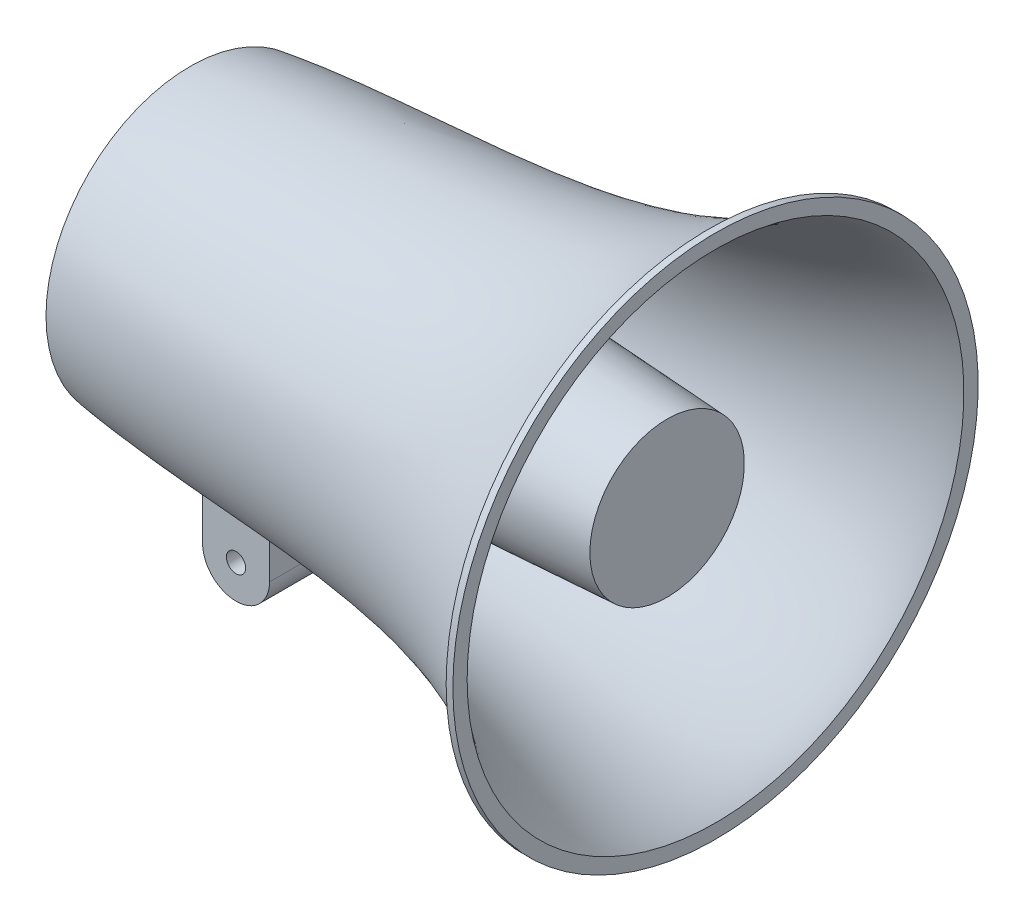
from build123d import *

# Parameters (mm, degrees)
SKETCH2_R           = 2.379603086
BOSS_EXTRUDE1_DEPTH = 7.62


with BuildPart() as part:
    # Sketch1 → Revolve1 (revolve)
    with BuildSketch(Plane.XY, mode=Mode.PRIVATE) as revolve1_sk:
        with BuildLine():
            Line((0, 0), (0, 35.56))
            add(Edge.make_bspline(
                [(0, 35.56), (42.301500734, 41.721758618), (90.804413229, 35.842754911), (127.882024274, 61.887461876)],
                knots=[0, 0, 0, 0, 1, 1, 1, 1], degree=3))
            Line((127.882024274, 61.887461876), (127.882024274, 64.77))
            Line((127.882024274, 64.77), (129.54, 64.77))
            Line((129.54, 64.77), (129.54, 61.251991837))
            add(Edge.make_bspline(
                [(129.54, 61.251991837), (122.108766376, 55.034053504), (92.759656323, 42.350538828), (60.579168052, 39.262131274), (48.26, 38.670416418)],
                knots=[0, 0, 0, 0, 0.471040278, 0.787254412, 0.787254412, 0.787254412, 0.787254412], degree=3))
            Line((48.26, 38.670416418), (48.26, 22.968138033))
            Line((48.26, 22.968138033), (117.602, 19.05))
            Line((117.602, 19.05), (117.602, 0))
            Line((117.602, 0), (0, 0))
        make_face()
    revolve(revolve1_sk.sketch.rotate(Axis((0, 0, 0), (1, 0, 0)), 90), axis=Axis((0, 0, 0), (1, 0, 0)))

    # Sketch2 → Boss-Extrude1 (add, symmetric)
    with BuildSketch(Plane.XY):
        with BuildLine():
            Line((10.668, -57.15), (10.668, 0))
            Line((10.668, 0), (27.178, 0))
            Line((27.178, 0), (27.178, -57.15))
            ThreePointArc((27.178, -57.15), (18.923, -65.405), (10.668, -57.15))
        make_face()
        with Locations(Location((18.923, -57.15, 0), (0, 0, 180))):
            Circle(SKETCH2_R, mode=Mode.SUBTRACT)
    extrude(amount=BOSS_EXTRUDE1_DEPTH, both=True)


solid = part.part
